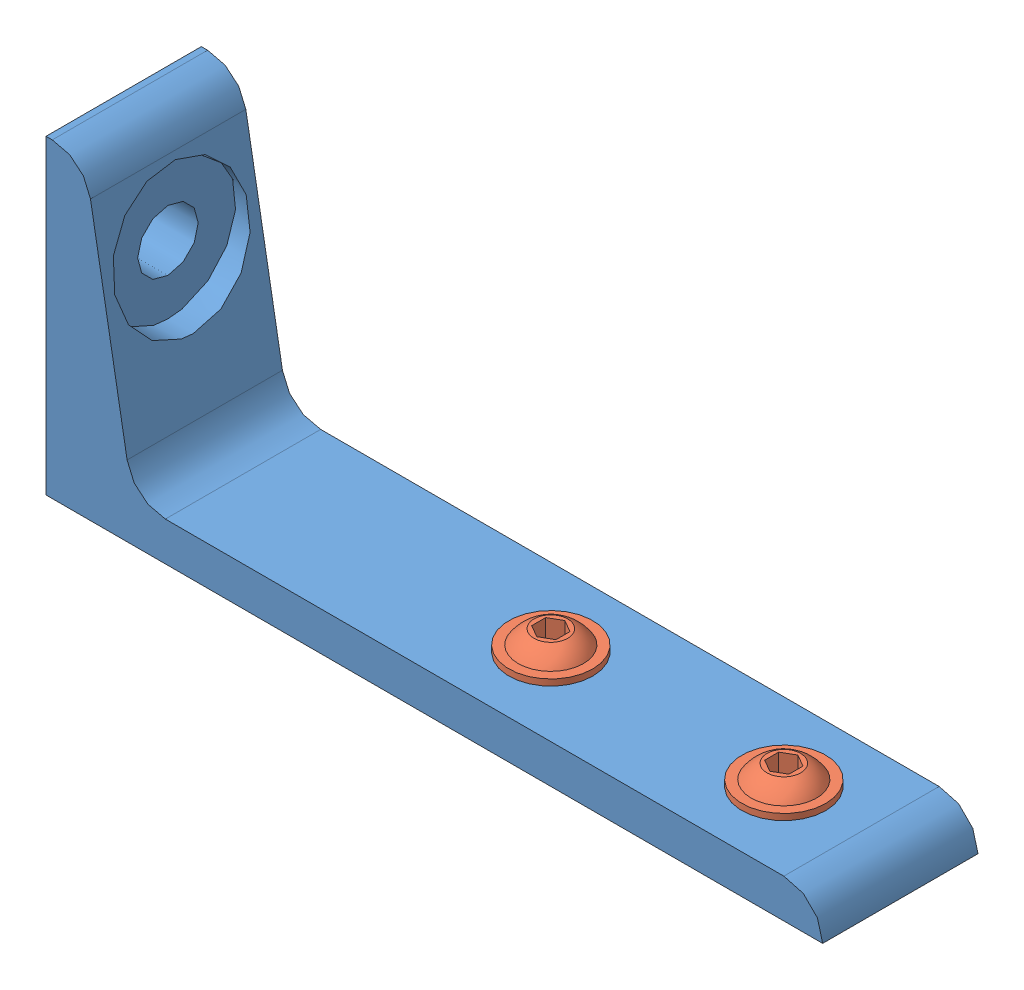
SolidWorks assembly 655275.sldasm, configuration 655275 (With Recomended Fasteners) (file format 4700). Lengths in mm.
Overall size (127 57.15 25.4).
7 component instances, 3 part files, 6 mates.
Components (placement in the parent):
- Econ BP-1: Econ BP.SLDPRT [655275] at origin size (127 50.8 25.4)
- 651130-1: 651130.SLDASM [Default] at (107.95 -6.35 0) x (0 0 1) z (-1 0 0) size (13.72 16 25.4)
  - FBHSCS-1: FBHSCS.SLDPRT [651136] at origin size (13.72 16 13.72)
  - 651163-1: 651163.SLDPRT [Default] at (-5.588 1.27 12.7) x (0 0 -1) z (0 -1 0) size (25.4 11.18 3.66)
- 651130-2: 651130.SLDASM [Default] at (69.85 -6.35 0) x (0 0 1) z (-1 0 0) size (13.72 16 25.4)
  - FBHSCS-1: FBHSCS.SLDPRT [651136] at origin size (13.72 16 13.72)
  - 651163-1: 651163.SLDPRT [Default] at (-5.588 1.27 12.7) x (0 0 -1) z (0 -1 0) size (25.4 11.18 3.66)
Mates (geometry in assembly coordinates):
- Concentric1: concentric aligned: cylinder of Econ BP-1 through (69.85 50.801 0) axis (0 -1 0) radius 3.2639; cylinder of 651130-2/FBHSCS-1 through (69.85 -6.35 0) axis (0 -1 0) radius 3.175
- Concentric2: concentric aligned: cylinder of Econ BP-1 through (107.95 50.801 0) axis (0 -1 0) radius 3.2639; cylinder of 651130-1/FBHSCS-1 through (107.95 -6.35 0) axis (0 -1 0) radius 3.175
- Coincident1: coincident aligned: plane of 651130-1/FBHSCS-1 through (107.95 6.35 3.175) normal (0 -1 0); plane of 651130-2/FBHSCS-1 through (69.85 6.35 3.175) normal (0 -1 0)
- Coincident2: coincident anti-aligned: plane of Econ BP-1 through (120.65 6.35 12.7) normal (0 1 0); plane of 651130-1/FBHSCS-1 through (107.95 6.35 3.175) normal (0 -1 0)
- Parallel1: parallel aligned: plane of 651130-1/651163-1 through (95.25 -2.6924 -5.588) normal (0 0 -1); plane of 651130-2/651163-1 through (57.15 -2.6924 -5.588) normal (0 0 -1)
- Parallel2: parallel anti-aligned: plane of Econ BP-1 through (120.65 0 12.7) normal (0 0 1); plane of 651130-2/651163-1 through (57.15 -2.6924 -5.588) normal (0 0 -1)
